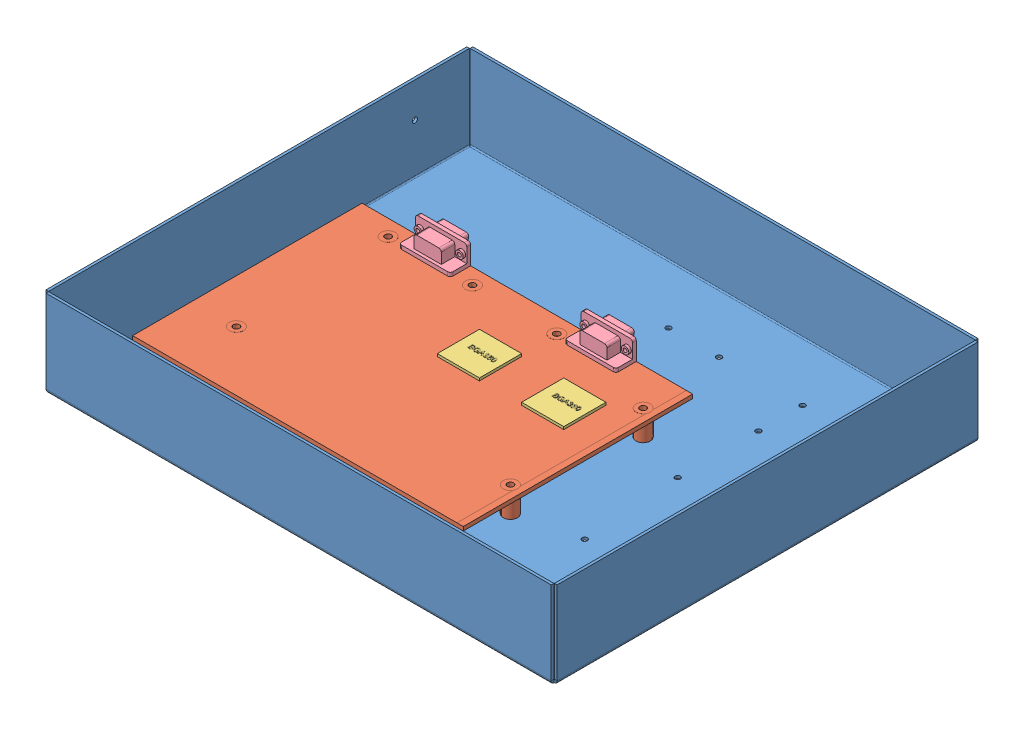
SolidWorks assembly Standard Cable - Simple.SLDASM, configuration Default (file format 3400). Lengths in mm.
Overall size (308 52.4 257.2).
7 component instances, 4 part files, 3 mates.
Components (placement in the parent):
- simple enclosure-1: simple enclosure.SLDPRT [Default] at origin size (308 52.4 257.2)
- main board-simple-1: main board-simple.SLDASM [Default] at (39.2169 14.3129 -176.3415) size (199.24 27.62 144.34)
  - LINECARD_PCB_BB8_V01-1: LINECARD_PCB_BB8_V01.sldprt [Default] at origin size (199.24 15.09 138.24)
  - BGA1X1(Default)-2: BGA1X1(Default).sldprt [Default] at (128.6516 2.3622 55.7784) x (1 0 0) z (0 1 0) size (25.4 25.4 2.68)
  - BGA1X1(Default)-3: BGA1X1(Default).sldprt [Default] at (77.8516 2.3622 55.7784) x (1 0 0) z (0 1 0) size (25.4 25.4 2.68)
  - SW3dPS-Connector D-Sub 9 pin RA Receptacle-4: SW3dPS-Connector D-Sub 9 pin RA Receptacle.SLDPRT [Default] at (38.8881 2.3622 2.286) x (-1 0 0) z (0 0 -1) size (30.89 12.55 18.34)
  - SW3dPS-Connector D-Sub 9 pin RA Receptacle-5: SW3dPS-Connector D-Sub 9 pin RA Receptacle.SLDPRT [Default] at (138.7191 2.3622 2.286) x (-1 0 0) z (0 0 -1) size (30.89 12.55 18.34)
Mates (geometry in assembly coordinates):
- Coincident1: coincident anti-aligned: plane of simple enclosure-1 through (0 1.6002 -254) normal (0 1 0); plane of main board-simple-1/LINECARD_PCB_BB8_V01-1 through (204.3169 1.6002 -154.1165) normal (0 -1 0)
- Distance1: distance = 38.1 mm anti-aligned: plane of simple enclosure-1 through (0 52.4002 0) normal (0 0 -1); plane of main board-simple-1/LINECARD_PCB_BB8_V01-1 through (211.9369 14.3002 -38.1) normal (0 0 1)
- Distance2: distance = 12.7 mm anti-aligned: plane of simple enclosure-1 through (0 1.6002 -254) normal (1 0 0); plane of main board-simple-1/LINECARD_PCB_BB8_V01-1 through (12.7 14.3002 -176.3415) normal (-1 0 0)
